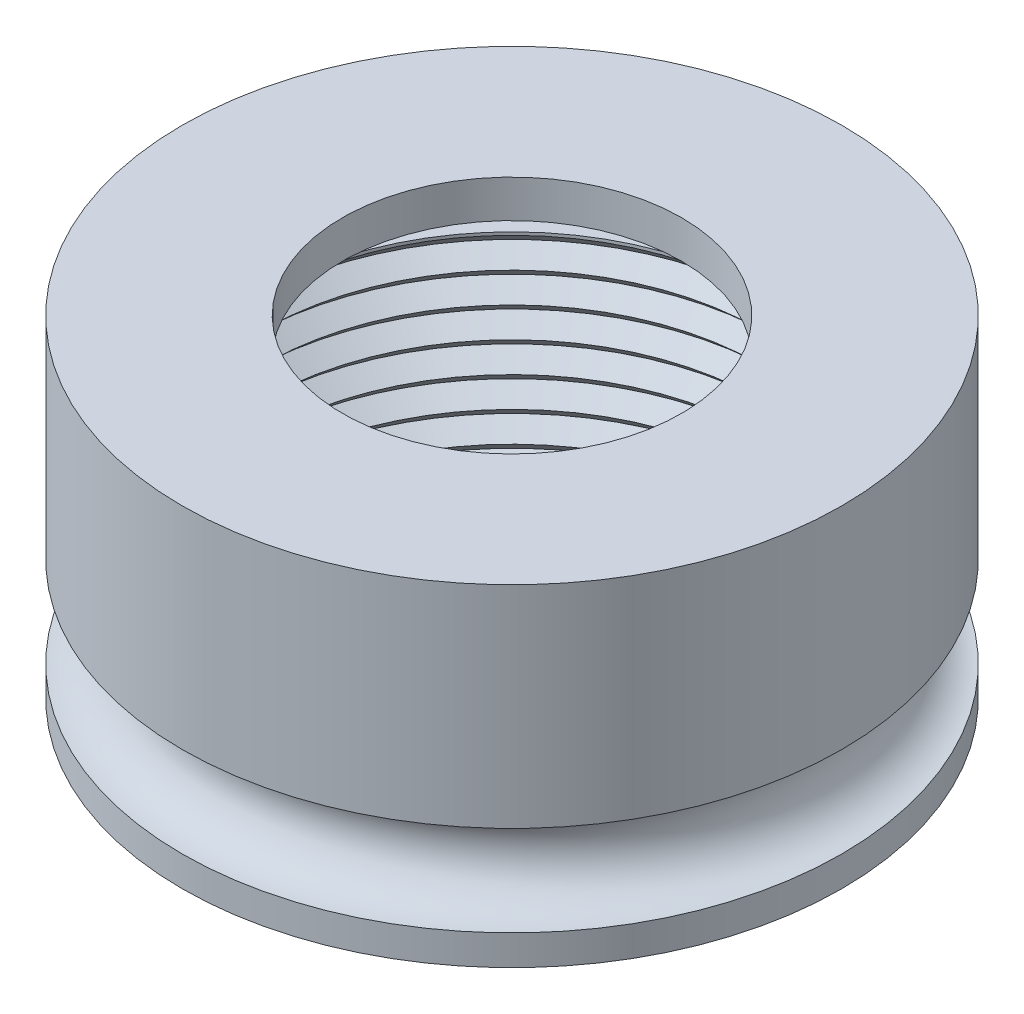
from build123d import *

# Parameters (mm, degrees)
SKETCH4_R = 1.905


with BuildPart() as part:
    # Sketch1 → Revolve1 (revolve)
    with BuildSketch(Plane.XY, mode=Mode.PRIVATE) as revolve1_sk:
        Polygon((7.14375, 0), (7.14375, 1.5875), (13.890625, 1.5875), (13.890625, -12.3825), (11.1125, -12.3825), (10.42543, -11.7475), (11.1125, -11.1125), (10.42543, -10.4775), (11.1125, -9.8425), (10.42543, -9.2075), (11.1125, -8.5725), (10.42543, -7.9375), (11.1125, -7.3025), (10.42543, -6.6675), (11.1125, -6.0325), (10.42543, -5.3975), (11.1125, -4.7625), (10.42543, -4.1275), (11.1125, -3.4925), (10.42543, -2.8575), (10.42543, -2.7305), (11.1125, -2.7305), (11.1125, 0), align=None)
    revolve(revolve1_sk.sketch.rotate(Axis((0, 0, 0), (0, 1, 0)), 90), axis=Axis((0, 0, 0), (0, 1, 0)))

    # Sketch4 → Cut-Revolve1 (revolve, cut)
    with BuildSketch(Plane.XY, mode=Mode.PRIVATE) as cut_revolve1_sk:
        with Locations((13.890625, -9.2075)):
            Circle(SKETCH4_R)
    revolve(cut_revolve1_sk.sketch.rotate(Axis((0, 0, 0), (0, 1, 0)), 90), axis=Axis((0, 0, 0), (0, 1, 0)), mode=Mode.SUBTRACT)


solid = part.part
